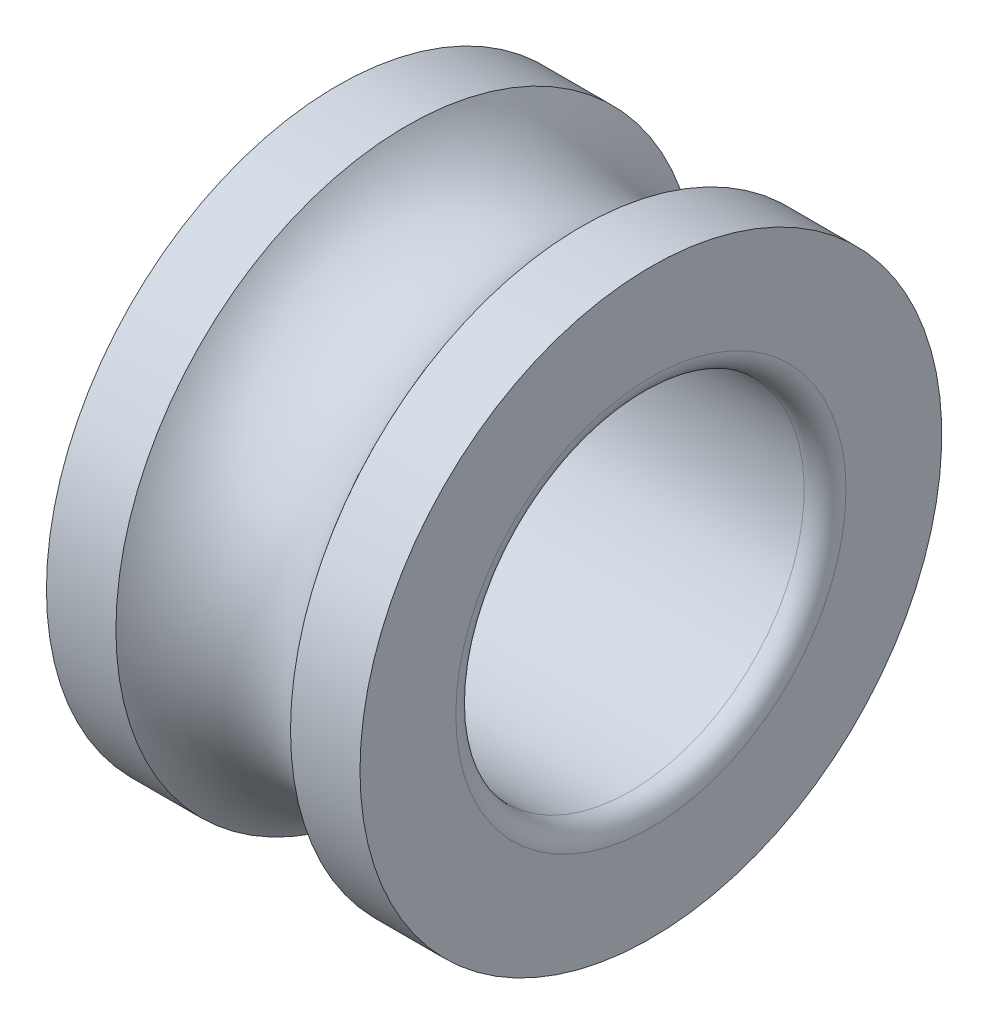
ISO-10303-21;
HEADER;
FILE_DESCRIPTION(('STEP AP214'),'2;1');
FILE_NAME('part.step','',(''),(''),'','','');
FILE_SCHEMA(('AUTOMOTIVE_DESIGN { 1 0 10303 214 1 1 1 1 }'));
ENDSEC;
DATA;
#1=APPLICATION_CONTEXT('core data for automotive mechanical design processes');
#2=APPLICATION_PROTOCOL_DEFINITION('international standard','automotive_design',2000,#1);
#3=PRODUCT_CONTEXT('',#1,'mechanical');
#4=PRODUCT('Part','Part','',(#3));
#5=PRODUCT_RELATED_PRODUCT_CATEGORY('part','',(#4));
#6=PRODUCT_DEFINITION_FORMATION('','',#4);
#7=PRODUCT_DEFINITION_CONTEXT('part definition',#1,'design');
#8=PRODUCT_DEFINITION('design','',#6,#7);
#9=PRODUCT_DEFINITION_SHAPE('','',#8);
#10=(LENGTH_UNIT() NAMED_UNIT(*) SI_UNIT(.MILLI.,.METRE.));
#11=(NAMED_UNIT(*) PLANE_ANGLE_UNIT() SI_UNIT($,.RADIAN.));
#12=(NAMED_UNIT(*) SI_UNIT($,.STERADIAN.) SOLID_ANGLE_UNIT());
#13=UNCERTAINTY_MEASURE_WITH_UNIT(LENGTH_MEASURE(1.E-05),#10,'distance_accuracy_value','');
#14=(GEOMETRIC_REPRESENTATION_CONTEXT(3) GLOBAL_UNCERTAINTY_ASSIGNED_CONTEXT((#13)) GLOBAL_UNIT_ASSIGNED_CONTEXT((#10,
#11,#12)) REPRESENTATION_CONTEXT('',''));
#15=CARTESIAN_POINT('',(0.,0.,0.));
#16=DIRECTION('',(0.,0.,1.));
#17=DIRECTION('',(1.,0.,0.));
#18=AXIS2_PLACEMENT_3D('',#15,#16,#17);
#19=CARTESIAN_POINT('',(8.4,0.,0.));
#20=DIRECTION('',(-1.,0.,0.));
#21=DIRECTION('',(0.,0.,1.));
#22=AXIS2_PLACEMENT_3D('',#19,#20,#21);
#23=TOROIDAL_SURFACE('',#22,5.6,0.6);
#24=CARTESIAN_POINT('',(9.,0.,0.));
#25=DIRECTION('',(-1.,0.,0.));
#26=DIRECTION('',(0.,0.,1.));
#27=AXIS2_PLACEMENT_3D('',#24,#25,#26);
#28=CIRCLE('',#27,5.6);
#29=CARTESIAN_POINT('',(9.,0.,5.6));
#30=VERTEX_POINT('',#29);
#31=EDGE_CURVE('E10',#30,#30,#28,.T.);
#32=ORIENTED_EDGE('',*,*,#31,.F.);
#33=EDGE_LOOP('',(#32));
#34=FACE_BOUND('',#33,.T.);
#35=CARTESIAN_POINT('',(8.4,0.,0.));
#36=DIRECTION('',(-1.,0.,0.));
#37=DIRECTION('',(0.,0.,1.));
#38=AXIS2_PLACEMENT_3D('',#35,#36,#37);
#39=CIRCLE('',#38,5.);
#40=CARTESIAN_POINT('',(8.4,0.,5.));
#41=VERTEX_POINT('',#40);
#42=EDGE_CURVE('E56',#41,#41,#39,.T.);
#43=ORIENTED_EDGE('',*,*,#42,.T.);
#44=EDGE_LOOP('',(#43));
#45=FACE_BOUND('',#44,.T.);
#46=ADVANCED_FACE('F14',(#34,#45),#23,.T.);
#47=CARTESIAN_POINT('',(9.,5.6,0.));
#48=DIRECTION('',(-1.,0.,0.));
#49=DIRECTION('',(0.,0.,1.));
#50=AXIS2_PLACEMENT_3D('',#47,#48,#49);
#51=PLANE('',#50);
#52=CARTESIAN_POINT('',(9.,0.,0.));
#53=DIRECTION('',(-1.,0.,0.));
#54=DIRECTION('',(0.,0.,1.));
#55=AXIS2_PLACEMENT_3D('',#52,#53,#54);
#56=CIRCLE('',#55,8.35);
#57=CARTESIAN_POINT('',(9.,0.,8.35));
#58=VERTEX_POINT('',#57);
#59=EDGE_CURVE('E21',#58,#58,#56,.T.);
#60=ORIENTED_EDGE('',*,*,#59,.F.);
#61=EDGE_LOOP('',(#60));
#62=FACE_BOUND('',#61,.T.);
#63=ORIENTED_EDGE('',*,*,#31,.T.);
#64=EDGE_LOOP('',(#63));
#65=FACE_BOUND('',#64,.T.);
#66=ADVANCED_FACE('F95',(#62,#65),#51,.F.);
#67=CARTESIAN_POINT('',(4.5,0.,0.));
#68=DIRECTION('',(-1.,0.,0.));
#69=DIRECTION('',(0.,0.,1.));
#70=AXIS2_PLACEMENT_3D('',#67,#68,#69);
#71=CYLINDRICAL_SURFACE('',#70,8.35);
#72=CARTESIAN_POINT('',(7.00549396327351,0.,0.));
#73=DIRECTION('',(-1.,0.,0.));
#74=DIRECTION('',(0.,0.,1.));
#75=AXIS2_PLACEMENT_3D('',#72,#73,#74);
#76=CIRCLE('',#75,8.35);
#77=CARTESIAN_POINT('',(7.00549396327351,0.,8.35));
#78=VERTEX_POINT('',#77);
#79=EDGE_CURVE('E30',#78,#78,#76,.T.);
#80=ORIENTED_EDGE('',*,*,#79,.F.);
#81=EDGE_LOOP('',(#80));
#82=FACE_BOUND('',#81,.T.);
#83=ORIENTED_EDGE('',*,*,#59,.T.);
#84=EDGE_LOOP('',(#83));
#85=FACE_BOUND('',#84,.T.);
#86=ADVANCED_FACE('F88',(#82,#85),#71,.T.);
#87=CARTESIAN_POINT('',(4.5,0.,0.));
#88=DIRECTION('',(-1.,0.,0.));
#89=DIRECTION('',(0.,0.,1.));
#90=AXIS2_PLACEMENT_3D('',#87,#88,#89);
#91=TOROIDAL_SURFACE('',#90,10.,3.);
#92=ORIENTED_EDGE('',*,*,#79,.T.);
#93=EDGE_LOOP('',(#92));
#94=FACE_BOUND('',#93,.T.);
#95=CARTESIAN_POINT('',(1.99450603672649,0.,0.));
#96=DIRECTION('',(-1.,0.,0.));
#97=DIRECTION('',(0.,0.,1.));
#98=AXIS2_PLACEMENT_3D('',#95,#96,#97);
#99=CIRCLE('',#98,8.35);
#100=CARTESIAN_POINT('',(1.99450603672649,0.,8.35));
#101=VERTEX_POINT('',#100);
#102=EDGE_CURVE('E38',#101,#101,#99,.T.);
#103=ORIENTED_EDGE('',*,*,#102,.F.);
#104=EDGE_LOOP('',(#103));
#105=FACE_BOUND('',#104,.T.);
#106=ADVANCED_FACE('F83',(#94,#105),#91,.F.);
#107=CARTESIAN_POINT('',(4.5,0.,0.));
#108=DIRECTION('',(-1.,0.,0.));
#109=DIRECTION('',(0.,0.,1.));
#110=AXIS2_PLACEMENT_3D('',#107,#108,#109);
#111=CYLINDRICAL_SURFACE('',#110,8.35);
#112=CARTESIAN_POINT('',(0.,0.,0.));
#113=DIRECTION('',(-1.,0.,0.));
#114=DIRECTION('',(0.,0.,1.));
#115=AXIS2_PLACEMENT_3D('',#112,#113,#114);
#116=CIRCLE('',#115,8.35);
#117=CARTESIAN_POINT('',(0.,0.,8.35));
#118=VERTEX_POINT('',#117);
#119=EDGE_CURVE('E44',#118,#118,#116,.T.);
#120=ORIENTED_EDGE('',*,*,#119,.F.);
#121=EDGE_LOOP('',(#120));
#122=FACE_BOUND('',#121,.T.);
#123=ORIENTED_EDGE('',*,*,#102,.T.);
#124=EDGE_LOOP('',(#123));
#125=FACE_BOUND('',#124,.T.);
#126=ADVANCED_FACE('F77',(#122,#125),#111,.T.);
#127=CARTESIAN_POINT('',(0.,8.35,0.));
#128=DIRECTION('',(1.,0.,0.));
#129=DIRECTION('',(0.,0.,-1.));
#130=AXIS2_PLACEMENT_3D('',#127,#128,#129);
#131=PLANE('',#130);
#132=CARTESIAN_POINT('',(0.,0.,0.));
#133=DIRECTION('',(-1.,0.,0.));
#134=DIRECTION('',(0.,0.,1.));
#135=AXIS2_PLACEMENT_3D('',#132,#133,#134);
#136=CIRCLE('',#135,5.6);
#137=CARTESIAN_POINT('',(0.,0.,5.6));
#138=VERTEX_POINT('',#137);
#139=EDGE_CURVE('E48',#138,#138,#136,.T.);
#140=ORIENTED_EDGE('',*,*,#139,.F.);
#141=EDGE_LOOP('',(#140));
#142=FACE_BOUND('',#141,.T.);
#143=ORIENTED_EDGE('',*,*,#119,.T.);
#144=EDGE_LOOP('',(#143));
#145=FACE_BOUND('',#144,.T.);
#146=ADVANCED_FACE('F71',(#142,#145),#131,.F.);
#147=CARTESIAN_POINT('',(0.6,0.,0.));
#148=DIRECTION('',(-1.,0.,0.));
#149=DIRECTION('',(0.,0.,1.));
#150=AXIS2_PLACEMENT_3D('',#147,#148,#149);
#151=TOROIDAL_SURFACE('',#150,5.6,0.6);
#152=CARTESIAN_POINT('',(0.6,0.,0.));
#153=DIRECTION('',(-1.,0.,0.));
#154=DIRECTION('',(0.,0.,1.));
#155=AXIS2_PLACEMENT_3D('',#152,#153,#154);
#156=CIRCLE('',#155,5.);
#157=CARTESIAN_POINT('',(0.6,0.,5.));
#158=VERTEX_POINT('',#157);
#159=EDGE_CURVE('E52',#158,#158,#156,.T.);
#160=ORIENTED_EDGE('',*,*,#159,.F.);
#161=EDGE_LOOP('',(#160));
#162=FACE_BOUND('',#161,.T.);
#163=ORIENTED_EDGE('',*,*,#139,.T.);
#164=EDGE_LOOP('',(#163));
#165=FACE_BOUND('',#164,.T.);
#166=ADVANCED_FACE('F65',(#162,#165),#151,.T.);
#167=CARTESIAN_POINT('',(4.5,0.,0.));
#168=DIRECTION('',(-1.,0.,0.));
#169=DIRECTION('',(0.,0.,1.));
#170=AXIS2_PLACEMENT_3D('',#167,#168,#169);
#171=CYLINDRICAL_SURFACE('',#170,5.);
#172=ORIENTED_EDGE('',*,*,#42,.F.);
#173=EDGE_LOOP('',(#172));
#174=FACE_BOUND('',#173,.T.);
#175=ORIENTED_EDGE('',*,*,#159,.T.);
#176=EDGE_LOOP('',(#175));
#177=FACE_BOUND('',#176,.T.);
#178=ADVANCED_FACE('F62',(#174,#177),#171,.F.);
#179=CLOSED_SHELL('',(#46,#66,#86,#106,#126,#146,#166,#178));
#180=MANIFOLD_SOLID_BREP('B1',#179);
#181=ADVANCED_BREP_SHAPE_REPRESENTATION('',(#18,#180),#14);
#182=SHAPE_DEFINITION_REPRESENTATION(#9,#181);
ENDSEC;
END-ISO-10303-21;
